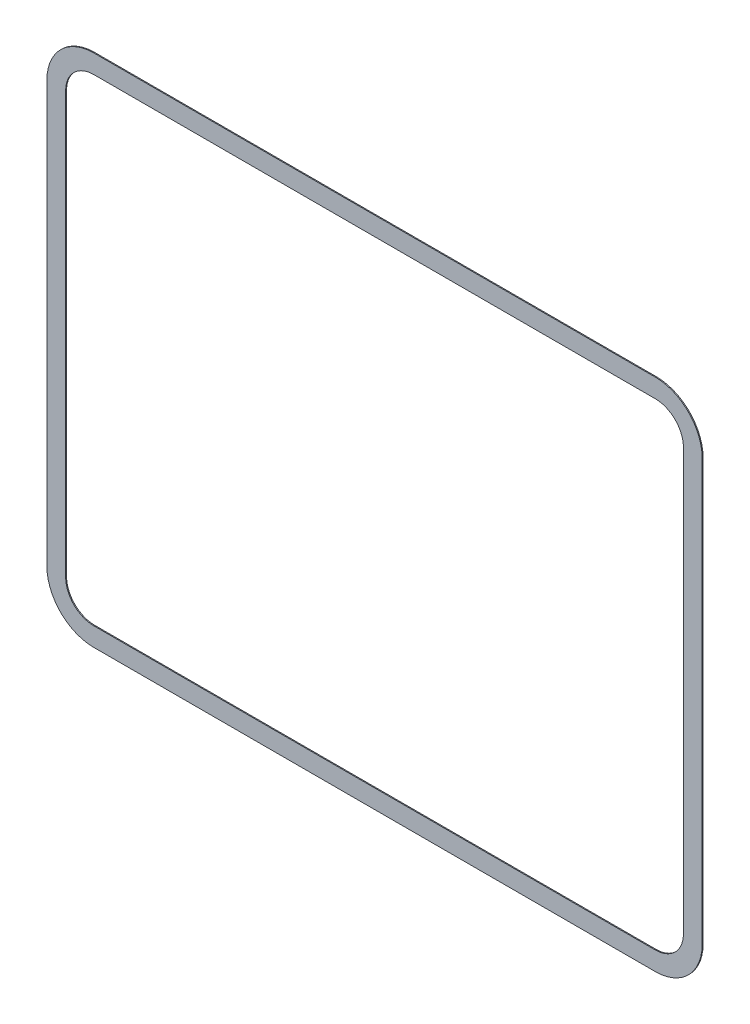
from build123d import *

# Parameters (mm, degrees)
EXTRUSION1_DEPTH = 0.1


with BuildPart() as part:
    # Esquisse1 → Extrusion1 (new body)
    with BuildSketch(Plane.XY):
        with BuildLine():
            Line((-65, 55), (-5, 55))
            ThreePointArc((-5, 55), (-1.464466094, 53.535533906), (0, 50))
            Line((0, 50), (0, 5))
            ThreePointArc((0, 5), (-1.464466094, 1.464466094), (-5, 0))
            Line((-5, 0), (-65, 0))
            ThreePointArc((-65, 0), (-68.535533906, 1.464466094), (-70, 5))
            Line((-70, 5), (-70, 50))
            ThreePointArc((-70, 50), (-68.535533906, 53.535533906), (-65, 55))
        make_face()
        with BuildLine():
            Line((-2, 50), (-2, 5))
            ThreePointArc((-2, 5), (-2.878679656, 2.878679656), (-5, 2))
            Line((-5, 2), (-65, 2))
            ThreePointArc((-65, 2), (-67.121320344, 2.878679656), (-68, 5))
            Line((-68, 5), (-68, 50))
            ThreePointArc((-68, 50), (-67.121320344, 52.121320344), (-65, 53))
            Line((-65, 53), (-5, 53))
            ThreePointArc((-5, 53), (-2.878679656, 52.121320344), (-2, 50))
        make_face(mode=Mode.SUBTRACT)
    extrude(amount=EXTRUSION1_DEPTH)


solid = part.part
